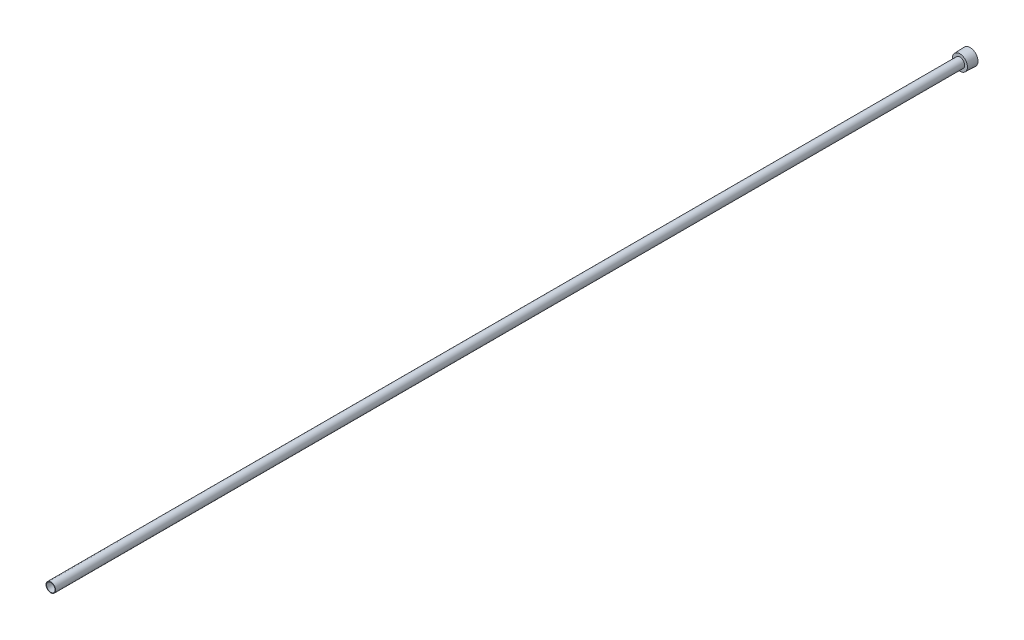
ISO-10303-21;
HEADER;
FILE_DESCRIPTION(('STEP AP214'),'2;1');
FILE_NAME('part.step','',(''),(''),'','','');
FILE_SCHEMA(('AUTOMOTIVE_DESIGN { 1 0 10303 214 1 1 1 1 }'));
ENDSEC;
DATA;
#1=APPLICATION_CONTEXT('core data for automotive mechanical design processes');
#2=APPLICATION_PROTOCOL_DEFINITION('international standard','automotive_design',2000,#1);
#3=PRODUCT_CONTEXT('',#1,'mechanical');
#4=PRODUCT('Part','Part','',(#3));
#5=PRODUCT_RELATED_PRODUCT_CATEGORY('part','',(#4));
#6=PRODUCT_DEFINITION_FORMATION('','',#4);
#7=PRODUCT_DEFINITION_CONTEXT('part definition',#1,'design');
#8=PRODUCT_DEFINITION('design','',#6,#7);
#9=PRODUCT_DEFINITION_SHAPE('','',#8);
#10=(LENGTH_UNIT() NAMED_UNIT(*) SI_UNIT(.MILLI.,.METRE.));
#11=(NAMED_UNIT(*) PLANE_ANGLE_UNIT() SI_UNIT($,.RADIAN.));
#12=(NAMED_UNIT(*) SI_UNIT($,.STERADIAN.) SOLID_ANGLE_UNIT());
#13=UNCERTAINTY_MEASURE_WITH_UNIT(LENGTH_MEASURE(1.E-05),#10,'distance_accuracy_value','');
#14=(GEOMETRIC_REPRESENTATION_CONTEXT(3) GLOBAL_UNCERTAINTY_ASSIGNED_CONTEXT((#13)) GLOBAL_UNIT_ASSIGNED_CONTEXT((#10,
#11,#12)) REPRESENTATION_CONTEXT('',''));
#15=CARTESIAN_POINT('',(0.,0.,0.));
#16=DIRECTION('',(0.,0.,1.));
#17=DIRECTION('',(1.,0.,0.));
#18=AXIS2_PLACEMENT_3D('',#15,#16,#17);
#19=CARTESIAN_POINT('',(0.,0.,0.));
#20=DIRECTION('',(0.,0.,1.));
#21=DIRECTION('',(1.,0.,0.));
#22=AXIS2_PLACEMENT_3D('',#19,#20,#21);
#23=CYLINDRICAL_SURFACE('',#22,5.6388);
#24=CARTESIAN_POINT('',(0.,0.,1219.2));
#25=DIRECTION('',(0.,0.,1.));
#26=DIRECTION('',(1.,0.,0.));
#27=AXIS2_PLACEMENT_3D('',#24,#25,#26);
#28=CIRCLE('',#27,5.6388);
#29=CARTESIAN_POINT('',(5.6388,0.,1219.2));
#30=VERTEX_POINT('',#29);
#31=EDGE_CURVE('E141',#30,#30,#28,.T.);
#32=CARTESIAN_POINT('',(0.,0.,9.525));
#33=DIRECTION('',(0.,0.,-1.));
#34=DIRECTION('',(-1.,0.,0.));
#35=AXIS2_PLACEMENT_3D('',#32,#33,#34);
#36=CIRCLE('',#35,5.6388);
#37=CARTESIAN_POINT('',(5.6388,0.,9.525));
#38=VERTEX_POINT('',#37);
#39=EDGE_CURVE('E36',#38,#38,#36,.F.);
#40=CARTESIAN_POINT('',(5.6388,0.,1219.2));
#41=CARTESIAN_POINT('',(5.6388,0.,1206.59921875));
#42=CARTESIAN_POINT('',(5.6388,0.,1193.9984375));
#43=CARTESIAN_POINT('',(5.6388,0.,1168.796875));
#44=CARTESIAN_POINT('',(5.6388,0.,1156.19609375));
#45=CARTESIAN_POINT('',(5.6388,0.,1130.99453125));
#46=CARTESIAN_POINT('',(5.6388,0.,1118.39375));
#47=CARTESIAN_POINT('',(5.6388,0.,1093.1921875));
#48=CARTESIAN_POINT('',(5.6388,0.,1080.59140625));
#49=CARTESIAN_POINT('',(5.6388,0.,1055.38984375));
#50=CARTESIAN_POINT('',(5.6388,0.,1042.7890625));
#51=CARTESIAN_POINT('',(5.6388,0.,1017.5875));
#52=CARTESIAN_POINT('',(5.6388,0.,1004.98671875));
#53=CARTESIAN_POINT('',(5.6388,0.,979.78515625));
#54=CARTESIAN_POINT('',(5.6388,0.,967.184375));
#55=CARTESIAN_POINT('',(5.6388,0.,941.9828125));
#56=CARTESIAN_POINT('',(5.6388,0.,929.38203125));
#57=CARTESIAN_POINT('',(5.6388,0.,904.18046875));
#58=CARTESIAN_POINT('',(5.6388,0.,891.5796875));
#59=CARTESIAN_POINT('',(5.6388,0.,866.378125));
#60=CARTESIAN_POINT('',(5.6388,0.,853.77734375));
#61=CARTESIAN_POINT('',(5.6388,0.,828.57578125));
#62=CARTESIAN_POINT('',(5.6388,0.,815.975));
#63=CARTESIAN_POINT('',(5.6388,0.,790.7734375));
#64=CARTESIAN_POINT('',(5.6388,0.,778.17265625));
#65=CARTESIAN_POINT('',(5.6388,0.,752.97109375));
#66=CARTESIAN_POINT('',(5.6388,0.,740.3703125));
#67=CARTESIAN_POINT('',(5.6388,0.,715.16875));
#68=CARTESIAN_POINT('',(5.6388,0.,702.56796875));
#69=CARTESIAN_POINT('',(5.6388,0.,677.36640625));
#70=CARTESIAN_POINT('',(5.6388,0.,664.765625));
#71=CARTESIAN_POINT('',(5.6388,0.,639.5640625));
#72=CARTESIAN_POINT('',(5.6388,0.,626.96328125));
#73=CARTESIAN_POINT('',(5.6388,0.,601.76171875));
#74=CARTESIAN_POINT('',(5.6388,0.,589.1609375));
#75=CARTESIAN_POINT('',(5.6388,0.,563.959375));
#76=CARTESIAN_POINT('',(5.6388,0.,551.35859375));
#77=CARTESIAN_POINT('',(5.6388,0.,526.15703125));
#78=CARTESIAN_POINT('',(5.6388,0.,513.55625));
#79=CARTESIAN_POINT('',(5.6388,0.,488.3546875));
#80=CARTESIAN_POINT('',(5.6388,0.,475.75390625));
#81=CARTESIAN_POINT('',(5.6388,0.,450.55234375));
#82=CARTESIAN_POINT('',(5.6388,0.,437.9515625));
#83=CARTESIAN_POINT('',(5.6388,0.,412.75));
#84=CARTESIAN_POINT('',(5.6388,0.,400.14921875));
#85=CARTESIAN_POINT('',(5.6388,0.,374.94765625));
#86=CARTESIAN_POINT('',(5.6388,0.,362.346875));
#87=CARTESIAN_POINT('',(5.6388,0.,337.1453125));
#88=CARTESIAN_POINT('',(5.6388,0.,324.54453125));
#89=CARTESIAN_POINT('',(5.6388,0.,299.34296875));
#90=CARTESIAN_POINT('',(5.6388,0.,286.7421875));
#91=CARTESIAN_POINT('',(5.6388,0.,261.540625));
#92=CARTESIAN_POINT('',(5.6388,0.,248.93984375));
#93=CARTESIAN_POINT('',(5.6388,0.,223.73828125));
#94=CARTESIAN_POINT('',(5.6388,0.,211.1375));
#95=CARTESIAN_POINT('',(5.6388,0.,185.9359375));
#96=CARTESIAN_POINT('',(5.6388,0.,173.33515625));
#97=CARTESIAN_POINT('',(5.6388,0.,148.13359375));
#98=CARTESIAN_POINT('',(5.6388,0.,135.5328125));
#99=CARTESIAN_POINT('',(5.6388,0.,110.33125));
#100=CARTESIAN_POINT('',(5.6388,0.,97.73046875));
#101=CARTESIAN_POINT('',(5.6388,0.,72.52890625));
#102=CARTESIAN_POINT('',(5.6388,0.,59.928125));
#103=CARTESIAN_POINT('',(5.6388,0.,34.7265624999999));
#104=CARTESIAN_POINT('',(5.6388,0.,22.12578125));
#105=CARTESIAN_POINT('',(5.6388,0.,9.525));
#106=B_SPLINE_CURVE_WITH_KNOTS('',3,(#40,#41,#42,#43,#44,#45,#46,#47,#48,#49,#50,#51,#52,#53,
#54,#55,#56,#57,#58,#59,#60,#61,#62,#63,#64,#65,#66,#67,#68,#69,#70,#71,#72,#73,#74,#75,#76,#77,
#78,#79,#80,#81,#82,#83,#84,#85,#86,#87,#88,#89,#90,#91,#92,#93,#94,#95,#96,#97,#98,#99,#100,
#101,#102,#103,#104,#105),.UNSPECIFIED.,.F.,.F.,(4,2,2,2,2,2,2,2,2,2,2,2,2,2,2,2,2,2,2,2,2,2,2,
2,2,2,2,2,2,2,2,2,4),(0.,37.8023437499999,75.6046875,113.40703125,151.209375,189.01171875,
226.8140625,264.61640625,302.41875,340.22109375,378.0234375,415.82578125,453.628125,
491.43046875,529.2328125,567.03515625,604.8375,642.63984375,680.4421875,718.24453125,756.046875,
793.84921875,831.6515625,869.45390625,907.25625,945.05859375,982.8609375,1020.66328125,
1058.465625,1096.26796875,1134.0703125,1171.87265625,1209.675),.UNSPECIFIED.);
#107=EDGE_CURVE('BSEAM32',#30,#38,#106,.T.);
#108=ORIENTED_EDGE('',*,*,#31,.T.);
#109=ORIENTED_EDGE('',*,*,#39,.F.);
#110=ORIENTED_EDGE('',*,*,#107,.T.);
#111=ORIENTED_EDGE('',*,*,#107,.F.);
#112=EDGE_LOOP('',(#108,#110,#109,#111));
#113=FACE_BOUND('',#112,.T.);
#114=ADVANCED_FACE('F32',(#113),#23,.F.);
#115=CARTESIAN_POINT('',(0.,0.,0.));
#116=DIRECTION('',(0.,0.,1.));
#117=DIRECTION('',(1.,0.,0.));
#118=AXIS2_PLACEMENT_3D('',#115,#116,#117);
#119=PLANE('',#118);
#120=DIRECTION('',(-0.866025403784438,0.5,0.));
#121=VECTOR('',#120,1.);
#122=CARTESIAN_POINT('',(0.,-7.33234841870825,0.));
#123=LINE('',#122,#121);
#124=CARTESIAN_POINT('',(0.,-7.33234841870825,0.));
#125=VERTEX_POINT('',#124);
#126=CARTESIAN_POINT('',(-6.35,-3.66617420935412,0.));
#127=VERTEX_POINT('',#126);
#128=EDGE_CURVE('E123',#125,#127,#123,.T.);
#129=ORIENTED_EDGE('',*,*,#128,.F.);
#130=DIRECTION('',(-0.866025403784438,-0.5,0.));
#131=VECTOR('',#130,1.);
#132=CARTESIAN_POINT('',(6.35,-3.66617420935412,0.));
#133=LINE('',#132,#131);
#134=CARTESIAN_POINT('',(6.35,-3.66617420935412,0.));
#135=VERTEX_POINT('',#134);
#136=EDGE_CURVE('E48',#135,#125,#133,.T.);
#137=ORIENTED_EDGE('',*,*,#136,.F.);
#138=DIRECTION('',(0.,-1.,0.));
#139=VECTOR('',#138,1.);
#140=CARTESIAN_POINT('',(6.35,3.66617420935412,0.));
#141=LINE('',#140,#139);
#142=CARTESIAN_POINT('',(6.35,3.66617420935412,0.));
#143=VERTEX_POINT('',#142);
#144=EDGE_CURVE('E132',#143,#135,#141,.T.);
#145=ORIENTED_EDGE('',*,*,#144,.F.);
#146=DIRECTION('',(0.866025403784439,-0.5,0.));
#147=VECTOR('',#146,1.);
#148=CARTESIAN_POINT('',(0.,7.33234841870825,0.));
#149=LINE('',#148,#147);
#150=CARTESIAN_POINT('',(0.,7.33234841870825,0.));
#151=VERTEX_POINT('',#150);
#152=EDGE_CURVE('E130',#151,#143,#149,.T.);
#153=ORIENTED_EDGE('',*,*,#152,.F.);
#154=DIRECTION('',(0.866025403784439,0.5,0.));
#155=VECTOR('',#154,1.);
#156=CARTESIAN_POINT('',(-6.35,3.66617420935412,0.));
#157=LINE('',#156,#155);
#158=CARTESIAN_POINT('',(-6.35,3.66617420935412,0.));
#159=VERTEX_POINT('',#158);
#160=EDGE_CURVE('E96',#159,#151,#157,.T.);
#161=ORIENTED_EDGE('',*,*,#160,.F.);
#162=DIRECTION('',(0.,1.,0.));
#163=VECTOR('',#162,1.);
#164=CARTESIAN_POINT('',(-6.35,-3.66617420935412,0.));
#165=LINE('',#164,#163);
#166=EDGE_CURVE('E126',#127,#159,#165,.T.);
#167=ORIENTED_EDGE('',*,*,#166,.F.);
#168=EDGE_LOOP('',(#129,#137,#145,#153,#161,#167));
#169=FACE_BOUND('',#168,.T.);
#170=CARTESIAN_POINT('',(0.,0.,0.));
#171=DIRECTION('',(0.,0.,1.));
#172=DIRECTION('',(1.,0.,0.));
#173=AXIS2_PLACEMENT_3D('',#170,#171,#172);
#174=CIRCLE('',#173,10.541);
#175=CARTESIAN_POINT('',(10.541,0.,0.));
#176=VERTEX_POINT('',#175);
#177=EDGE_CURVE('E11',#176,#176,#174,.T.);
#178=ORIENTED_EDGE('',*,*,#177,.F.);
#179=EDGE_LOOP('',(#178));
#180=FACE_BOUND('',#179,.T.);
#181=ADVANCED_FACE('F34',(#169,#180),#119,.F.);
#182=CARTESIAN_POINT('',(0.,0.,0.));
#183=DIRECTION('',(0.,0.,-1.));
#184=DIRECTION('',(-1.,0.,0.));
#185=AXIS2_PLACEMENT_3D('',#182,#183,#184);
#186=CONICAL_SURFACE('',#185,10.541,0.0364599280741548);
#187=CARTESIAN_POINT('',(0.,0.,13.4874));
#188=DIRECTION('',(0.,0.,1.));
#189=DIRECTION('',(1.,0.,0.));
#190=AXIS2_PLACEMENT_3D('',#187,#188,#189);
#191=CIRCLE('',#190,10.0490323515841);
#192=CARTESIAN_POINT('',(10.0490323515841,0.,13.4874));
#193=VERTEX_POINT('',#192);
#194=EDGE_CURVE('E41',#193,#193,#191,.T.);
#195=ORIENTED_EDGE('',*,*,#194,.F.);
#196=EDGE_LOOP('',(#195));
#197=FACE_BOUND('',#196,.T.);
#198=ORIENTED_EDGE('',*,*,#177,.T.);
#199=EDGE_LOOP('',(#198));
#200=FACE_BOUND('',#199,.T.);
#201=ADVANCED_FACE('F155',(#197,#200),#186,.T.);
#202=CARTESIAN_POINT('',(0.,10.0490323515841,13.4874));
#203=DIRECTION('',(0.,0.,-1.));
#204=DIRECTION('',(-1.,0.,0.));
#205=AXIS2_PLACEMENT_3D('',#202,#203,#204);
#206=PLANE('',#205);
#207=CARTESIAN_POINT('',(0.,0.,13.4874));
#208=DIRECTION('',(0.,0.,1.));
#209=DIRECTION('',(1.,0.,0.));
#210=AXIS2_PLACEMENT_3D('',#207,#208,#209);
#211=CIRCLE('',#210,6.35);
#212=CARTESIAN_POINT('',(6.35,0.,13.4874));
#213=VERTEX_POINT('',#212);
#214=EDGE_CURVE('E147',#213,#213,#211,.T.);
#215=ORIENTED_EDGE('',*,*,#214,.F.);
#216=EDGE_LOOP('',(#215));
#217=FACE_BOUND('',#216,.T.);
#218=ORIENTED_EDGE('',*,*,#194,.T.);
#219=EDGE_LOOP('',(#218));
#220=FACE_BOUND('',#219,.T.);
#221=ADVANCED_FACE('F153',(#217,#220),#206,.F.);
#222=CARTESIAN_POINT('',(0.,0.,223.212151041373));
#223=DIRECTION('',(0.,0.,1.));
#224=DIRECTION('',(1.,0.,0.));
#225=AXIS2_PLACEMENT_3D('',#222,#223,#224);
#226=CYLINDRICAL_SURFACE('',#225,6.34999999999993);
#227=CARTESIAN_POINT('',(0.,0.,1219.2));
#228=DIRECTION('',(0.,0.,1.));
#229=DIRECTION('',(1.,0.,0.));
#230=AXIS2_PLACEMENT_3D('',#227,#228,#229);
#231=CIRCLE('',#230,6.34999999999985);
#232=CARTESIAN_POINT('',(6.34999999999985,0.,1219.2));
#233=VERTEX_POINT('',#232);
#234=EDGE_CURVE('E144',#233,#233,#231,.T.);
#235=ORIENTED_EDGE('',*,*,#234,.F.);
#236=EDGE_LOOP('',(#235));
#237=FACE_BOUND('',#236,.T.);
#238=ORIENTED_EDGE('',*,*,#214,.T.);
#239=EDGE_LOOP('',(#238));
#240=FACE_BOUND('',#239,.T.);
#241=ADVANCED_FACE('F189',(#237,#240),#226,.T.);
#242=CARTESIAN_POINT('',(0.,6.34999999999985,1219.2));
#243=DIRECTION('',(0.,0.,-1.));
#244=DIRECTION('',(-1.,0.,0.));
#245=AXIS2_PLACEMENT_3D('',#242,#243,#244);
#246=PLANE('',#245);
#247=ORIENTED_EDGE('',*,*,#31,.F.);
#248=EDGE_LOOP('',(#247));
#249=FACE_BOUND('',#248,.T.);
#250=ORIENTED_EDGE('',*,*,#234,.T.);
#251=EDGE_LOOP('',(#250));
#252=FACE_BOUND('',#251,.T.);
#253=ADVANCED_FACE('F182',(#249,#252),#246,.F.);
#254=CARTESIAN_POINT('',(0.,-7.33234841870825,9.525));
#255=DIRECTION('',(0.,0.,-1.));
#256=DIRECTION('',(-1.,0.,0.));
#257=AXIS2_PLACEMENT_3D('',#254,#255,#256);
#258=PLANE('',#257);
#259=DIRECTION('',(-0.866025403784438,-0.5,0.));
#260=VECTOR('',#259,1.);
#261=CARTESIAN_POINT('',(6.35,-3.66617420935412,9.525));
#262=LINE('',#261,#260);
#263=CARTESIAN_POINT('',(6.35,-3.66617420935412,9.525));
#264=VERTEX_POINT('',#263);
#265=CARTESIAN_POINT('',(0.,-7.33234841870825,9.525));
#266=VERTEX_POINT('',#265);
#267=EDGE_CURVE('E134',#264,#266,#262,.T.);
#268=ORIENTED_EDGE('',*,*,#267,.T.);
#269=DIRECTION('',(-0.866025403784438,0.5,0.));
#270=VECTOR('',#269,1.);
#271=CARTESIAN_POINT('',(0.,-7.33234841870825,9.525));
#272=LINE('',#271,#270);
#273=CARTESIAN_POINT('',(-6.35,-3.66617420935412,9.525));
#274=VERTEX_POINT('',#273);
#275=EDGE_CURVE('E117',#266,#274,#272,.T.);
#276=ORIENTED_EDGE('',*,*,#275,.T.);
#277=DIRECTION('',(0.,1.,0.));
#278=VECTOR('',#277,1.);
#279=CARTESIAN_POINT('',(-6.35,-3.66617420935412,9.525));
#280=LINE('',#279,#278);
#281=CARTESIAN_POINT('',(-6.35,3.66617420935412,9.525));
#282=VERTEX_POINT('',#281);
#283=EDGE_CURVE('E115',#274,#282,#280,.T.);
#284=ORIENTED_EDGE('',*,*,#283,.T.);
#285=DIRECTION('',(0.866025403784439,0.5,0.));
#286=VECTOR('',#285,1.);
#287=CARTESIAN_POINT('',(-6.35,3.66617420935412,9.525));
#288=LINE('',#287,#286);
#289=CARTESIAN_POINT('',(0.,7.33234841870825,9.525));
#290=VERTEX_POINT('',#289);
#291=EDGE_CURVE('E93',#282,#290,#288,.T.);
#292=ORIENTED_EDGE('',*,*,#291,.T.);
#293=DIRECTION('',(0.866025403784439,-0.5,0.));
#294=VECTOR('',#293,1.);
#295=CARTESIAN_POINT('',(0.,7.33234841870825,9.525));
#296=LINE('',#295,#294);
#297=CARTESIAN_POINT('',(6.35,3.66617420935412,9.525));
#298=VERTEX_POINT('',#297);
#299=EDGE_CURVE('E104',#290,#298,#296,.T.);
#300=ORIENTED_EDGE('',*,*,#299,.T.);
#301=DIRECTION('',(0.,-1.,0.));
#302=VECTOR('',#301,1.);
#303=CARTESIAN_POINT('',(6.35,3.66617420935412,9.525));
#304=LINE('',#303,#302);
#305=EDGE_CURVE('E108',#298,#264,#304,.T.);
#306=ORIENTED_EDGE('',*,*,#305,.T.);
#307=EDGE_LOOP('',(#268,#276,#284,#292,#300,#306));
#308=FACE_BOUND('',#307,.T.);
#309=ORIENTED_EDGE('',*,*,#39,.T.);
#310=EDGE_LOOP('',(#309));
#311=FACE_BOUND('',#310,.T.);
#312=ADVANCED_FACE('F111',(#308,#311),#258,.T.);
#313=CARTESIAN_POINT('',(6.35,-3.66617420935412,9.525));
#314=DIRECTION('',(0.5,-0.866025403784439,0.));
#315=DIRECTION('',(0.866025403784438,0.5,0.));
#316=AXIS2_PLACEMENT_3D('',#313,#314,#315);
#317=PLANE('',#316);
#318=ORIENTED_EDGE('',*,*,#136,.T.);
#319=DIRECTION('',(0.,0.,-1.));
#320=VECTOR('',#319,1.);
#321=CARTESIAN_POINT('',(0.,-7.33234841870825,9.525));
#322=LINE('',#321,#320);
#323=EDGE_CURVE('E78',#266,#125,#322,.T.);
#324=ORIENTED_EDGE('',*,*,#323,.F.);
#325=ORIENTED_EDGE('',*,*,#267,.F.);
#326=DIRECTION('',(0.,0.,-1.));
#327=VECTOR('',#326,1.);
#328=CARTESIAN_POINT('',(6.35,-3.66617420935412,9.525));
#329=LINE('',#328,#327);
#330=EDGE_CURVE('E56',#264,#135,#329,.T.);
#331=ORIENTED_EDGE('',*,*,#330,.T.);
#332=EDGE_LOOP('',(#318,#324,#325,#331));
#333=FACE_BOUND('',#332,.T.);
#334=ADVANCED_FACE('F173',(#333),#317,.F.);
#335=CARTESIAN_POINT('',(6.35,3.66617420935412,9.525));
#336=DIRECTION('',(1.,0.,0.));
#337=DIRECTION('',(0.,0.,-1.));
#338=AXIS2_PLACEMENT_3D('',#335,#336,#337);
#339=PLANE('',#338);
#340=ORIENTED_EDGE('',*,*,#144,.T.);
#341=ORIENTED_EDGE('',*,*,#330,.F.);
#342=ORIENTED_EDGE('',*,*,#305,.F.);
#343=DIRECTION('',(0.,0.,-1.));
#344=VECTOR('',#343,1.);
#345=CARTESIAN_POINT('',(6.35,3.66617420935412,9.525));
#346=LINE('',#345,#344);
#347=EDGE_CURVE('E100',#298,#143,#346,.T.);
#348=ORIENTED_EDGE('',*,*,#347,.T.);
#349=EDGE_LOOP('',(#340,#341,#342,#348));
#350=FACE_BOUND('',#349,.T.);
#351=ADVANCED_FACE('F175',(#350),#339,.F.);
#352=CARTESIAN_POINT('',(0.,7.33234841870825,9.525));
#353=DIRECTION('',(0.5,0.866025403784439,0.));
#354=DIRECTION('',(-0.866025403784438,0.5,0.));
#355=AXIS2_PLACEMENT_3D('',#352,#353,#354);
#356=PLANE('',#355);
#357=ORIENTED_EDGE('',*,*,#152,.T.);
#358=ORIENTED_EDGE('',*,*,#347,.F.);
#359=ORIENTED_EDGE('',*,*,#299,.F.);
#360=DIRECTION('',(0.,0.,-1.));
#361=VECTOR('',#360,1.);
#362=CARTESIAN_POINT('',(0.,7.33234841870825,9.525));
#363=LINE('',#362,#361);
#364=EDGE_CURVE('E89',#290,#151,#363,.T.);
#365=ORIENTED_EDGE('',*,*,#364,.T.);
#366=EDGE_LOOP('',(#357,#358,#359,#365));
#367=FACE_BOUND('',#366,.T.);
#368=ADVANCED_FACE('F105',(#367),#356,.F.);
#369=CARTESIAN_POINT('',(-6.35,3.66617420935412,9.525));
#370=DIRECTION('',(-0.5,0.866025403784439,0.));
#371=DIRECTION('',(-0.866025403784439,-0.5,0.));
#372=AXIS2_PLACEMENT_3D('',#369,#370,#371);
#373=PLANE('',#372);
#374=ORIENTED_EDGE('',*,*,#160,.T.);
#375=ORIENTED_EDGE('',*,*,#364,.F.);
#376=ORIENTED_EDGE('',*,*,#291,.F.);
#377=DIRECTION('',(0.,0.,-1.));
#378=VECTOR('',#377,1.);
#379=CARTESIAN_POINT('',(-6.35,3.66617420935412,9.525));
#380=LINE('',#379,#378);
#381=EDGE_CURVE('E101',#282,#159,#380,.T.);
#382=ORIENTED_EDGE('',*,*,#381,.T.);
#383=EDGE_LOOP('',(#374,#375,#376,#382));
#384=FACE_BOUND('',#383,.T.);
#385=ADVANCED_FACE('F91',(#384),#373,.F.);
#386=CARTESIAN_POINT('',(-6.35,-3.66617420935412,9.525));
#387=DIRECTION('',(-1.,0.,0.));
#388=DIRECTION('',(0.,-1.,0.));
#389=AXIS2_PLACEMENT_3D('',#386,#387,#388);
#390=PLANE('',#389);
#391=ORIENTED_EDGE('',*,*,#166,.T.);
#392=ORIENTED_EDGE('',*,*,#381,.F.);
#393=ORIENTED_EDGE('',*,*,#283,.F.);
#394=DIRECTION('',(0.,0.,-1.));
#395=VECTOR('',#394,1.);
#396=CARTESIAN_POINT('',(-6.35,-3.66617420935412,9.525));
#397=LINE('',#396,#395);
#398=EDGE_CURVE('E138',#274,#127,#397,.T.);
#399=ORIENTED_EDGE('',*,*,#398,.T.);
#400=EDGE_LOOP('',(#391,#392,#393,#399));
#401=FACE_BOUND('',#400,.T.);
#402=ADVANCED_FACE('F245',(#401),#390,.F.);
#403=CARTESIAN_POINT('',(0.,-7.33234841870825,9.525));
#404=DIRECTION('',(-0.5,-0.866025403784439,0.));
#405=DIRECTION('',(0.866025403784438,-0.5,0.));
#406=AXIS2_PLACEMENT_3D('',#403,#404,#405);
#407=PLANE('',#406);
#408=ORIENTED_EDGE('',*,*,#128,.T.);
#409=ORIENTED_EDGE('',*,*,#398,.F.);
#410=ORIENTED_EDGE('',*,*,#275,.F.);
#411=ORIENTED_EDGE('',*,*,#323,.T.);
#412=EDGE_LOOP('',(#408,#409,#410,#411));
#413=FACE_BOUND('',#412,.T.);
#414=ADVANCED_FACE('F171',(#413),#407,.F.);
#415=CLOSED_SHELL('',(#114,#181,#201,#221,#241,#253,#312,#334,#351,#368,#385,#402,#414));
#416=MANIFOLD_SOLID_BREP('B2',#415);
#417=ADVANCED_BREP_SHAPE_REPRESENTATION('',(#18,#416),#14);
#418=SHAPE_DEFINITION_REPRESENTATION(#9,#417);
ENDSEC;
END-ISO-10303-21;
